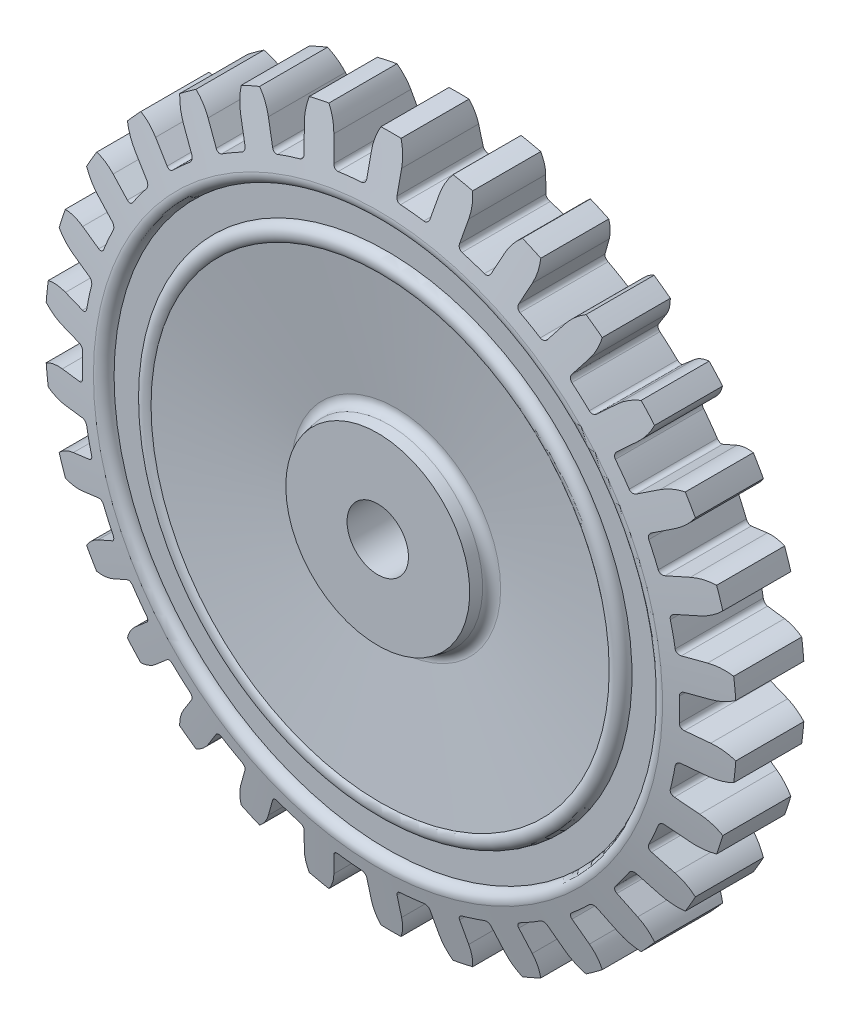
from build123d import *

# Parameters (mm, degrees)
SKETCH_6_OUTSIDE_W  = 96
SKETCH_6_OUTSIDE_H  = 96
CUT_EXTRUDE_3_DEPTH = 5


with BuildPart() as part:
    # Sketch 1 → Revolve 1 (revolve)
    with BuildSketch(Plane(origin=(0, 0, 0), x_dir=(1, 0, 0), z_dir=(0, 1, 0))):
        with BuildLine():
            Line((-36.6, -3.6), (-36.6, 3.6))
            Line((-36.6, 3.6), (-30.116325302, 4.978147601))
            ThreePointArc((-30.116325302, 4.978147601), (-29.27909322, 4.777145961), (-28.908413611, 4))
            Line((-28.908413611, 4), (-25.908413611, 4))
            ThreePointArc((-25.908413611, 4), (-25.319851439, 4.911437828), (-24.246975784, 4.75))
            Line((-24.246975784, 4.75), (-11.068617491, 3.062662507))
            ThreePointArc((-11.068617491, 3.062662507), (-10.357340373, 3.24300954), (-9.960660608, 3.860330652))
            Line((-9.960660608, 3.860330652), (-9.735, 5))
            Line((-9.735, 5), (-3.25, 5))
            Line((-3.25, 5), (-3.25, -5))
            Line((-3.25, -5), (-9.735, -5))
            Line((-9.735, -5), (-9.960660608, -3.860330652))
            ThreePointArc((-9.960660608, -3.860330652), (-10.357340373, -3.24300954), (-11.068617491, -3.062662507))
            Line((-11.068617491, -3.062662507), (-24.246975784, -4.75))
            ThreePointArc((-24.246975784, -4.75), (-25.319851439, -4.911437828), (-25.908413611, -4))
            Line((-25.908413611, -4), (-28.908413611, -4))
            ThreePointArc((-28.908413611, -4), (-29.27909322, -4.777145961), (-30.116325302, -4.978147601))
            Line((-30.116325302, -4.978147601), (-36.6, -3.6))
        make_face()
    revolve(axis=Axis((0, 0, -5), (0, 0, 1)))

    # Sketch 6 outside → Cut-Extrude 3 (cut, symmetric)
    with BuildSketch(Plane.XY):
        Rectangle(SKETCH_6_OUTSIDE_W, SKETCH_6_OUTSIDE_H)
        with BuildLine():
            Line((1.6, 34.332054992), (1.6, 32.031234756))
            ThreePointArc((1.6, 32.031234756), (1.735064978, 31.689441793), (2.06728972, 31.532305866))
            ThreePointArc((2.06728972, 31.532305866), (3.303099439, 31.426891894), (4.533820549, 31.273063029))
            ThreePointArc((4.533820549, 31.273063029), (4.891455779, 31.357691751), (5.094632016, 31.663934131))
            Line((5.094632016, 31.663934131), (5.572999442, 33.914475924))
            ThreePointArc((5.572999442, 33.914475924), (5.946602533, 35.018627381), (6.56570824, 36.006269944))
            ThreePointArc((6.56570824, 36.006269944), (7.609567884, 35.800202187), (8.646996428, 35.563878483))
            ThreePointArc((8.646996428, 35.563878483), (8.810867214, 34.409809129), (8.703071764, 33.249158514))
            Line((8.703071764, 33.249158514), (8.224704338, 30.99861672))
            ThreePointArc((8.224704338, 30.99861672), (8.28575507, 30.636211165), (8.578049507, 30.413435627))
            ThreePointArc((8.578049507, 30.413435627), (9.764937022, 30.053385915), (10.936781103, 29.647037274))
            ThreePointArc((10.936781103, 29.647037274), (11.304196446, 29.65546011), (11.566604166, 29.912767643))
            Line((11.566604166, 29.912767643), (12.502432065, 32.014671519))
            ThreePointArc((12.502432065, 32.014671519), (13.097437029, 33.017018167), (13.908356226, 33.854359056))
            ThreePointArc((13.908356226, 33.854359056), (14.886561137, 33.43576375), (15.852184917, 32.988910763))
            ThreePointArc((15.852184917, 32.988910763), (15.772530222, 31.825989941), (15.42577753, 30.713114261))
            Line((15.42577753, 30.713114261), (14.48994963, 28.611210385))
            ThreePointArc((14.48994963, 28.611210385), (14.474317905, 28.2440311), (14.713907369, 27.965352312))
            ThreePointArc((14.713907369, 27.965352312), (15.8, 27.36640276), (16.861751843, 26.725293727))
            ThreePointArc((16.861751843, 26.725293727), (17.222889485, 26.657142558), (17.533060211, 26.854269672))
            Line((17.533060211, 26.854269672), (18.885448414, 28.715672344))
            ThreePointArc((18.885448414, 28.715672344), (19.675850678, 29.572406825), (20.643142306, 30.222850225))
            ThreePointArc((20.643142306, 30.222850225), (21.512940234, 29.610021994), (22.364556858, 28.972169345))
            ThreePointArc((22.364556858, 28.972169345), (22.044857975, 27.851222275), (21.474302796, 26.834759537))
            Line((21.474302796, 26.834759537), (20.121914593, 24.973356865))
            ThreePointArc((20.121914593, 24.973356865), (20.030283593, 24.617451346), (20.206696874, 24.295048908))
            ThreePointArc((20.206696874, 24.295048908), (21.144527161, 23.483376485), (22.049783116, 22.635526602))
            ThreePointArc((22.049783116, 22.635526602), (22.388859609, 22.493779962), (22.733237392, 22.622111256))
            Line((22.733237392, 22.622111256), (24.443080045, 24.161660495))
            ThreePointArc((24.443080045, 24.161660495), (25.394335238, 24.835339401), (26.47572401, 25.270457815))
            ThreePointArc((26.47572401, 25.270457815), (27.199100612, 24.490180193), (27.899490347, 23.689205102))
            ThreePointArc((27.899490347, 23.689205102), (27.353719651, 22.65922255), (26.584297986, 21.783597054))
            Line((26.584297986, 21.783597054), (24.874455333, 20.244047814))
            ThreePointArc((24.874455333, 20.244047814), (24.710829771, 19.914970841), (24.816356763, 19.562935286))
            ThreePointArc((24.816356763, 19.562935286), (25.564937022, 18.574013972), (26.27413306, 17.556478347))
            ThreePointArc((26.27413306, 17.556478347), (26.576329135, 17.347331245), (26.939863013, 17.401258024))
            Line((26.939863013, 17.401258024), (28.932431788, 18.551668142))
            ThreePointArc((28.932431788, 18.551668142), (30.002965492, 19.012848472), (31.15118953, 19.213625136))
            ThreePointArc((31.15118953, 19.213625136), (31.696529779, 18.3), (32.215082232, 17.370908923))
            ThreePointArc((32.215082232, 17.370908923), (31.467092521, 16.476906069), (30.532431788, 15.78038685))
            Line((30.532431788, 15.78038685), (28.539863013, 14.629976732))
            ThreePointArc((28.539863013, 14.629976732), (28.311394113, 14.342110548), (28.34142278, 13.975827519))
            ThreePointArc((28.34142278, 13.975827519), (28.868036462, 12.852877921), (29.350177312, 11.710127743))
            ThreePointArc((29.350177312, 11.710127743), (29.60228555, 11.44272091), (29.969087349, 11.419886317))
            Line((29.969087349, 11.419886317), (32.157297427, 12.130878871))
            ThreePointArc((32.157297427, 12.130878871), (33.300322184, 12.359404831), (34.465198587, 12.317064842))
            ThreePointArc((34.465198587, 12.317064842), (34.808668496, 11.310021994), (35.122720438, 10.293420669))
            ThreePointArc((35.122720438, 10.293420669), (34.205202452, 9.574469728), (33.146151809, 9.087498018))
            Line((33.146151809, 9.087498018), (30.957941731, 8.376505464))
            ThreePointArc((30.957941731, 8.376505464), (30.674614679, 8.142431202), (30.627832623, 7.777909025))
            ThreePointArc((30.627832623, 7.777909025), (30.909464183, 6.57000943), (31.143477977, 5.351988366))
            ThreePointArc((31.143477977, 5.351988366), (31.334480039, 5.038008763), (31.688518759, 4.939410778))
            Line((31.688518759, 4.939410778), (33.976734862, 5.179911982))
            ThreePointArc((33.976734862, 5.179911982), (35.142295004, 5.165795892), (36.272913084, 4.882189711))
            ThreePointArc((36.272913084, 4.882189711), (36.39950137, 3.825741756), (36.495327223, 2.766060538))
            ThreePointArc((36.495327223, 2.766060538), (35.448380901, 2.253583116), (34.311225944, 1.997441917))
            Line((34.311225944, 1.997441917), (32.023009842, 1.756940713))
            ThreePointArc((32.023009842, 1.756940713), (31.697207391, 1.586888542), (31.575659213, 1.240058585))
            ThreePointArc((31.575659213, 1.240058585), (31.6, 0), (31.575659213, -1.240058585))
            ThreePointArc((31.575659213, -1.240058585), (31.697207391, -1.586888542), (32.023009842, -1.756940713))
            Line((32.023009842, -1.756940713), (34.311225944, -1.997441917))
            ThreePointArc((34.311225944, -1.997441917), (35.448380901, -2.253583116), (36.495327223, -2.766060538))
            ThreePointArc((36.495327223, -2.766060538), (36.39950137, -3.825741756), (36.272913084, -4.882189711))
            ThreePointArc((36.272913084, -4.882189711), (35.142295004, -5.165795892), (33.976734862, -5.179911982))
            Line((33.976734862, -5.179911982), (31.688518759, -4.939410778))
            ThreePointArc((31.688518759, -4.939410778), (31.334480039, -5.038008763), (31.143477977, -5.351988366))
            ThreePointArc((31.143477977, -5.351988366), (30.909464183, -6.57000943), (30.627832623, -7.777909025))
            ThreePointArc((30.627832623, -7.777909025), (30.674614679, -8.142431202), (30.957941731, -8.376505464))
            Line((30.957941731, -8.376505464), (33.146151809, -9.087498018))
            ThreePointArc((33.146151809, -9.087498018), (34.205202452, -9.574469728), (35.122720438, -10.293420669))
            ThreePointArc((35.122720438, -10.293420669), (34.808668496, -11.310021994), (34.465198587, -12.317064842))
            ThreePointArc((34.465198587, -12.317064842), (33.300322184, -12.359404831), (32.157297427, -12.130878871))
            Line((32.157297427, -12.130878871), (29.969087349, -11.419886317))
            ThreePointArc((29.969087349, -11.419886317), (29.60228555, -11.44272091), (29.350177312, -11.710127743))
            ThreePointArc((29.350177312, -11.710127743), (28.868036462, -12.852877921), (28.34142278, -13.975827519))
            ThreePointArc((28.34142278, -13.975827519), (28.311394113, -14.342110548), (28.539863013, -14.629976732))
            Line((28.539863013, -14.629976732), (30.532431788, -15.78038685))
            ThreePointArc((30.532431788, -15.78038685), (31.467092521, -16.476906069), (32.215082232, -17.370908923))
            ThreePointArc((32.215082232, -17.370908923), (31.696529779, -18.3), (31.15118953, -19.213625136))
            ThreePointArc((31.15118953, -19.213625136), (30.002965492, -19.012848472), (28.932431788, -18.551668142))
            Line((28.932431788, -18.551668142), (26.939863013, -17.401258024))
            ThreePointArc((26.939863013, -17.401258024), (26.576329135, -17.347331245), (26.27413306, -17.556478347))
            ThreePointArc((26.27413306, -17.556478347), (25.564937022, -18.574013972), (24.816356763, -19.562935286))
            ThreePointArc((24.816356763, -19.562935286), (24.710829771, -19.914970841), (24.874455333, -20.244047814))
            Line((24.874455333, -20.244047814), (26.584297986, -21.783597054))
            ThreePointArc((26.584297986, -21.783597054), (27.353719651, -22.65922255), (27.899490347, -23.689205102))
            ThreePointArc((27.899490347, -23.689205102), (27.199100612, -24.490180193), (26.47572401, -25.270457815))
            ThreePointArc((26.47572401, -25.270457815), (25.394335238, -24.835339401), (24.443080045, -24.161660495))
            Line((24.443080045, -24.161660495), (22.733237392, -22.622111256))
            ThreePointArc((22.733237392, -22.622111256), (22.388859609, -22.493779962), (22.049783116, -22.635526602))
            ThreePointArc((22.049783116, -22.635526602), (21.144527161, -23.483376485), (20.206696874, -24.295048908))
            ThreePointArc((20.206696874, -24.295048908), (20.030283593, -24.617451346), (20.121914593, -24.973356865))
            Line((20.121914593, -24.973356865), (21.474302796, -26.834759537))
            ThreePointArc((21.474302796, -26.834759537), (22.044857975, -27.851222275), (22.364556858, -28.972169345))
            ThreePointArc((22.364556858, -28.972169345), (21.512940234, -29.610021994), (20.643142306, -30.222850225))
            ThreePointArc((20.643142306, -30.222850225), (19.675850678, -29.572406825), (18.885448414, -28.715672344))
            Line((18.885448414, -28.715672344), (17.533060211, -26.854269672))
            ThreePointArc((17.533060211, -26.854269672), (17.222889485, -26.657142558), (16.861751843, -26.725293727))
            ThreePointArc((16.861751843, -26.725293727), (15.8, -27.36640276), (14.713907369, -27.965352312))
            ThreePointArc((14.713907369, -27.965352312), (14.474317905, -28.2440311), (14.48994963, -28.611210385))
            Line((14.48994963, -28.611210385), (15.42577753, -30.713114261))
            ThreePointArc((15.42577753, -30.713114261), (15.772530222, -31.825989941), (15.852184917, -32.988910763))
            ThreePointArc((15.852184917, -32.988910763), (14.886561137, -33.43576375), (13.908356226, -33.854359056))
            ThreePointArc((13.908356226, -33.854359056), (13.097437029, -33.017018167), (12.502432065, -32.014671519))
            Line((12.502432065, -32.014671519), (11.566604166, -29.912767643))
            ThreePointArc((11.566604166, -29.912767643), (11.304196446, -29.65546011), (10.936781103, -29.647037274))
            ThreePointArc((10.936781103, -29.647037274), (9.764937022, -30.053385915), (8.578049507, -30.413435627))
            ThreePointArc((8.578049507, -30.413435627), (8.28575507, -30.636211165), (8.224704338, -30.99861672))
            Line((8.224704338, -30.99861672), (8.703071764, -33.249158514))
            ThreePointArc((8.703071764, -33.249158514), (8.810867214, -34.409809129), (8.646996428, -35.563878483))
            ThreePointArc((8.646996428, -35.563878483), (7.609567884, -35.800202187), (6.56570824, -36.006269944))
            ThreePointArc((6.56570824, -36.006269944), (5.946602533, -35.018627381), (5.572999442, -33.914475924))
            Line((5.572999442, -33.914475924), (5.094632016, -31.663934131))
            ThreePointArc((5.094632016, -31.663934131), (4.891455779, -31.357691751), (4.533820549, -31.273063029))
            ThreePointArc((4.533820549, -31.273063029), (3.303099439, -31.426891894), (2.06728972, -31.532305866))
            ThreePointArc((2.06728972, -31.532305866), (1.735064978, -31.689441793), (1.6, -32.031234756))
            Line((1.6, -32.031234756), (1.6, -34.332054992))
            ThreePointArc((1.6, -34.332054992), (1.464127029, -35.489754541), (1.063892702, -36.584534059))
            ThreePointArc((1.063892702, -36.584534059), (0, -36.6), (-1.063892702, -36.584534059))
            ThreePointArc((-1.063892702, -36.584534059), (-1.464127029, -35.489754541), (-1.6, -34.332054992))
            Line((-1.6, -34.332054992), (-1.6, -32.031234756))
            ThreePointArc((-1.6, -32.031234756), (-1.735064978, -31.689441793), (-2.06728972, -31.532305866))
            ThreePointArc((-2.06728972, -31.532305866), (-3.303099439, -31.426891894), (-4.533820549, -31.273063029))
            ThreePointArc((-4.533820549, -31.273063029), (-4.891455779, -31.357691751), (-5.094632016, -31.663934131))
            Line((-5.094632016, -31.663934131), (-5.572999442, -33.914475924))
            ThreePointArc((-5.572999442, -33.914475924), (-5.946602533, -35.018627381), (-6.56570824, -36.006269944))
            ThreePointArc((-6.56570824, -36.006269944), (-7.609567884, -35.800202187), (-8.646996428, -35.563878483))
            ThreePointArc((-8.646996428, -35.563878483), (-8.810867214, -34.409809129), (-8.703071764, -33.249158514))
            Line((-8.703071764, -33.249158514), (-8.224704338, -30.99861672))
            ThreePointArc((-8.224704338, -30.99861672), (-8.28575507, -30.636211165), (-8.578049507, -30.413435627))
            ThreePointArc((-8.578049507, -30.413435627), (-9.764937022, -30.053385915), (-10.936781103, -29.647037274))
            ThreePointArc((-10.936781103, -29.647037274), (-11.304196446, -29.65546011), (-11.566604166, -29.912767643))
            Line((-11.566604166, -29.912767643), (-12.502432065, -32.014671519))
            ThreePointArc((-12.502432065, -32.014671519), (-13.097437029, -33.017018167), (-13.908356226, -33.854359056))
            ThreePointArc((-13.908356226, -33.854359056), (-14.886561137, -33.43576375), (-15.852184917, -32.988910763))
            ThreePointArc((-15.852184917, -32.988910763), (-15.772530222, -31.825989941), (-15.42577753, -30.713114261))
            Line((-15.42577753, -30.713114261), (-14.48994963, -28.611210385))
            ThreePointArc((-14.48994963, -28.611210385), (-14.474317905, -28.2440311), (-14.713907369, -27.965352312))
            ThreePointArc((-14.713907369, -27.965352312), (-15.8, -27.36640276), (-16.861751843, -26.725293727))
            ThreePointArc((-16.861751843, -26.725293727), (-17.222889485, -26.657142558), (-17.533060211, -26.854269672))
            Line((-17.533060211, -26.854269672), (-18.885448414, -28.715672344))
            ThreePointArc((-18.885448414, -28.715672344), (-19.675850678, -29.572406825), (-20.643142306, -30.222850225))
            ThreePointArc((-20.643142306, -30.222850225), (-21.512940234, -29.610021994), (-22.364556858, -28.972169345))
            ThreePointArc((-22.364556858, -28.972169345), (-22.044857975, -27.851222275), (-21.474302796, -26.834759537))
            Line((-21.474302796, -26.834759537), (-20.121914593, -24.973356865))
            ThreePointArc((-20.121914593, -24.973356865), (-20.030283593, -24.617451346), (-20.206696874, -24.295048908))
            ThreePointArc((-20.206696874, -24.295048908), (-21.144527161, -23.483376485), (-22.049783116, -22.635526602))
            ThreePointArc((-22.049783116, -22.635526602), (-22.388859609, -22.493779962), (-22.733237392, -22.622111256))
            Line((-22.733237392, -22.622111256), (-24.443080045, -24.161660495))
            ThreePointArc((-24.443080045, -24.161660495), (-25.394335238, -24.835339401), (-26.47572401, -25.270457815))
            ThreePointArc((-26.47572401, -25.270457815), (-27.199100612, -24.490180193), (-27.899490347, -23.689205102))
            ThreePointArc((-27.899490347, -23.689205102), (-27.353719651, -22.65922255), (-26.584297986, -21.783597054))
            Line((-26.584297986, -21.783597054), (-24.874455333, -20.244047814))
            ThreePointArc((-24.874455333, -20.244047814), (-24.710829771, -19.914970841), (-24.816356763, -19.562935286))
            ThreePointArc((-24.816356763, -19.562935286), (-25.564937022, -18.574013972), (-26.27413306, -17.556478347))
            ThreePointArc((-26.27413306, -17.556478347), (-26.576329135, -17.347331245), (-26.939863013, -17.401258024))
            Line((-26.939863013, -17.401258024), (-28.932431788, -18.551668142))
            ThreePointArc((-28.932431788, -18.551668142), (-30.002965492, -19.012848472), (-31.15118953, -19.213625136))
            ThreePointArc((-31.15118953, -19.213625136), (-31.696529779, -18.3), (-32.215082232, -17.370908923))
            ThreePointArc((-32.215082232, -17.370908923), (-31.467092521, -16.476906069), (-30.532431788, -15.78038685))
            Line((-30.532431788, -15.78038685), (-28.539863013, -14.629976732))
            ThreePointArc((-28.539863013, -14.629976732), (-28.311394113, -14.342110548), (-28.34142278, -13.975827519))
            ThreePointArc((-28.34142278, -13.975827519), (-28.868036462, -12.852877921), (-29.350177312, -11.710127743))
            ThreePointArc((-29.350177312, -11.710127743), (-29.60228555, -11.44272091), (-29.969087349, -11.419886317))
            Line((-29.969087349, -11.419886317), (-32.157297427, -12.130878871))
            ThreePointArc((-32.157297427, -12.130878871), (-33.300322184, -12.359404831), (-34.465198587, -12.317064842))
            ThreePointArc((-34.465198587, -12.317064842), (-34.808668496, -11.310021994), (-35.122720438, -10.293420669))
            ThreePointArc((-35.122720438, -10.293420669), (-34.205202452, -9.574469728), (-33.146151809, -9.087498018))
            Line((-33.146151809, -9.087498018), (-30.957941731, -8.376505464))
            ThreePointArc((-30.957941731, -8.376505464), (-30.674614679, -8.142431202), (-30.627832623, -7.777909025))
            ThreePointArc((-30.627832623, -7.777909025), (-30.909464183, -6.57000943), (-31.143477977, -5.351988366))
            ThreePointArc((-31.143477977, -5.351988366), (-31.334480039, -5.038008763), (-31.688518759, -4.939410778))
            Line((-31.688518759, -4.939410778), (-33.976734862, -5.179911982))
            ThreePointArc((-33.976734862, -5.179911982), (-35.142295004, -5.165795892), (-36.272913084, -4.882189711))
            ThreePointArc((-36.272913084, -4.882189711), (-36.39950137, -3.825741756), (-36.495327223, -2.766060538))
            ThreePointArc((-36.495327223, -2.766060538), (-35.448380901, -2.253583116), (-34.311225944, -1.997441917))
            Line((-34.311225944, -1.997441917), (-32.023009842, -1.756940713))
            ThreePointArc((-32.023009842, -1.756940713), (-31.697207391, -1.586888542), (-31.575659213, -1.240058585))
            ThreePointArc((-31.575659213, -1.240058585), (-31.6, 0), (-31.575659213, 1.240058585))
            ThreePointArc((-31.575659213, 1.240058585), (-31.697207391, 1.586888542), (-32.023009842, 1.756940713))
            Line((-32.023009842, 1.756940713), (-34.311225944, 1.997441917))
            ThreePointArc((-34.311225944, 1.997441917), (-35.448380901, 2.253583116), (-36.495327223, 2.766060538))
            ThreePointArc((-36.495327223, 2.766060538), (-36.39950137, 3.825741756), (-36.272913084, 4.882189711))
            ThreePointArc((-36.272913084, 4.882189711), (-35.142295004, 5.165795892), (-33.976734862, 5.179911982))
            Line((-33.976734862, 5.179911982), (-31.688518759, 4.939410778))
            ThreePointArc((-31.688518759, 4.939410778), (-31.334480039, 5.038008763), (-31.143477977, 5.351988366))
            ThreePointArc((-31.143477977, 5.351988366), (-30.909464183, 6.57000943), (-30.627832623, 7.777909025))
            ThreePointArc((-30.627832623, 7.777909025), (-30.674614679, 8.142431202), (-30.957941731, 8.376505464))
            Line((-30.957941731, 8.376505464), (-33.146151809, 9.087498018))
            ThreePointArc((-33.146151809, 9.087498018), (-34.205202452, 9.574469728), (-35.122720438, 10.293420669))
            ThreePointArc((-35.122720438, 10.293420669), (-34.808668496, 11.310021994), (-34.465198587, 12.317064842))
            ThreePointArc((-34.465198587, 12.317064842), (-33.300322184, 12.359404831), (-32.157297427, 12.130878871))
            Line((-32.157297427, 12.130878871), (-29.969087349, 11.419886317))
            ThreePointArc((-29.969087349, 11.419886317), (-29.60228555, 11.44272091), (-29.350177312, 11.710127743))
            ThreePointArc((-29.350177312, 11.710127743), (-28.868036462, 12.852877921), (-28.34142278, 13.975827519))
            ThreePointArc((-28.34142278, 13.975827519), (-28.311394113, 14.342110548), (-28.539863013, 14.629976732))
            Line((-28.539863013, 14.629976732), (-30.532431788, 15.78038685))
            ThreePointArc((-30.532431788, 15.78038685), (-31.467092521, 16.476906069), (-32.215082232, 17.370908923))
            ThreePointArc((-32.215082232, 17.370908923), (-31.696529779, 18.3), (-31.15118953, 19.213625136))
            ThreePointArc((-31.15118953, 19.213625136), (-30.002965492, 19.012848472), (-28.932431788, 18.551668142))
            Line((-28.932431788, 18.551668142), (-26.939863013, 17.401258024))
            ThreePointArc((-26.939863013, 17.401258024), (-26.576329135, 17.347331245), (-26.27413306, 17.556478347))
            ThreePointArc((-26.27413306, 17.556478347), (-25.564937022, 18.574013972), (-24.816356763, 19.562935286))
            ThreePointArc((-24.816356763, 19.562935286), (-24.710829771, 19.914970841), (-24.874455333, 20.244047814))
            Line((-24.874455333, 20.244047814), (-26.584297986, 21.783597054))
            ThreePointArc((-26.584297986, 21.783597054), (-27.353719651, 22.65922255), (-27.899490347, 23.689205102))
            ThreePointArc((-27.899490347, 23.689205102), (-27.199100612, 24.490180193), (-26.47572401, 25.270457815))
            ThreePointArc((-26.47572401, 25.270457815), (-25.394335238, 24.835339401), (-24.443080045, 24.161660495))
            Line((-24.443080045, 24.161660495), (-22.733237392, 22.622111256))
            ThreePointArc((-22.733237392, 22.622111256), (-22.388859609, 22.493779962), (-22.049783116, 22.635526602))
            ThreePointArc((-22.049783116, 22.635526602), (-21.144527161, 23.483376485), (-20.206696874, 24.295048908))
            ThreePointArc((-20.206696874, 24.295048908), (-20.030283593, 24.617451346), (-20.121914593, 24.973356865))
            Line((-20.121914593, 24.973356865), (-21.474302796, 26.834759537))
            ThreePointArc((-21.474302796, 26.834759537), (-22.044857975, 27.851222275), (-22.364556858, 28.972169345))
            ThreePointArc((-22.364556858, 28.972169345), (-21.512940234, 29.610021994), (-20.643142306, 30.222850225))
            ThreePointArc((-20.643142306, 30.222850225), (-19.675850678, 29.572406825), (-18.885448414, 28.715672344))
            Line((-18.885448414, 28.715672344), (-17.533060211, 26.854269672))
            ThreePointArc((-17.533060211, 26.854269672), (-17.222889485, 26.657142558), (-16.861751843, 26.725293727))
            ThreePointArc((-16.861751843, 26.725293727), (-15.8, 27.36640276), (-14.713907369, 27.965352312))
            ThreePointArc((-14.713907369, 27.965352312), (-14.474317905, 28.2440311), (-14.48994963, 28.611210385))
            Line((-14.48994963, 28.611210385), (-15.42577753, 30.713114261))
            ThreePointArc((-15.42577753, 30.713114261), (-15.772530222, 31.825989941), (-15.852184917, 32.988910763))
            ThreePointArc((-15.852184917, 32.988910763), (-14.886561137, 33.43576375), (-13.908356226, 33.854359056))
            ThreePointArc((-13.908356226, 33.854359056), (-13.097437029, 33.017018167), (-12.502432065, 32.014671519))
            Line((-12.502432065, 32.014671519), (-11.566604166, 29.912767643))
            ThreePointArc((-11.566604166, 29.912767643), (-11.304196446, 29.65546011), (-10.936781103, 29.647037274))
            ThreePointArc((-10.936781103, 29.647037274), (-9.764937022, 30.053385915), (-8.578049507, 30.413435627))
            ThreePointArc((-8.578049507, 30.413435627), (-8.28575507, 30.636211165), (-8.224704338, 30.99861672))
            Line((-8.224704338, 30.99861672), (-8.703071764, 33.249158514))
            ThreePointArc((-8.703071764, 33.249158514), (-8.810867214, 34.409809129), (-8.646996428, 35.563878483))
            ThreePointArc((-8.646996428, 35.563878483), (-7.609567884, 35.800202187), (-6.56570824, 36.006269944))
            ThreePointArc((-6.56570824, 36.006269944), (-5.946602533, 35.018627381), (-5.572999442, 33.914475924))
            Line((-5.572999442, 33.914475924), (-5.094632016, 31.663934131))
            ThreePointArc((-5.094632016, 31.663934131), (-4.891455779, 31.357691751), (-4.533820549, 31.273063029))
            ThreePointArc((-4.533820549, 31.273063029), (-3.303099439, 31.426891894), (-2.06728972, 31.532305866))
            ThreePointArc((-2.06728972, 31.532305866), (-1.735064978, 31.689441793), (-1.6, 32.031234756))
            Line((-1.6, 32.031234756), (-1.6, 34.332054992))
            ThreePointArc((-1.6, 34.332054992), (-1.464127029, 35.489754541), (-1.063892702, 36.584534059))
            ThreePointArc((-1.063892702, 36.584534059), (0, 36.6), (1.063892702, 36.584534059))
            ThreePointArc((1.063892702, 36.584534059), (1.464127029, 35.489754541), (1.6, 34.332054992))
        make_face(mode=Mode.SUBTRACT)
    extrude(amount=CUT_EXTRUDE_3_DEPTH, both=True, mode=Mode.SUBTRACT)


solid = part.part
